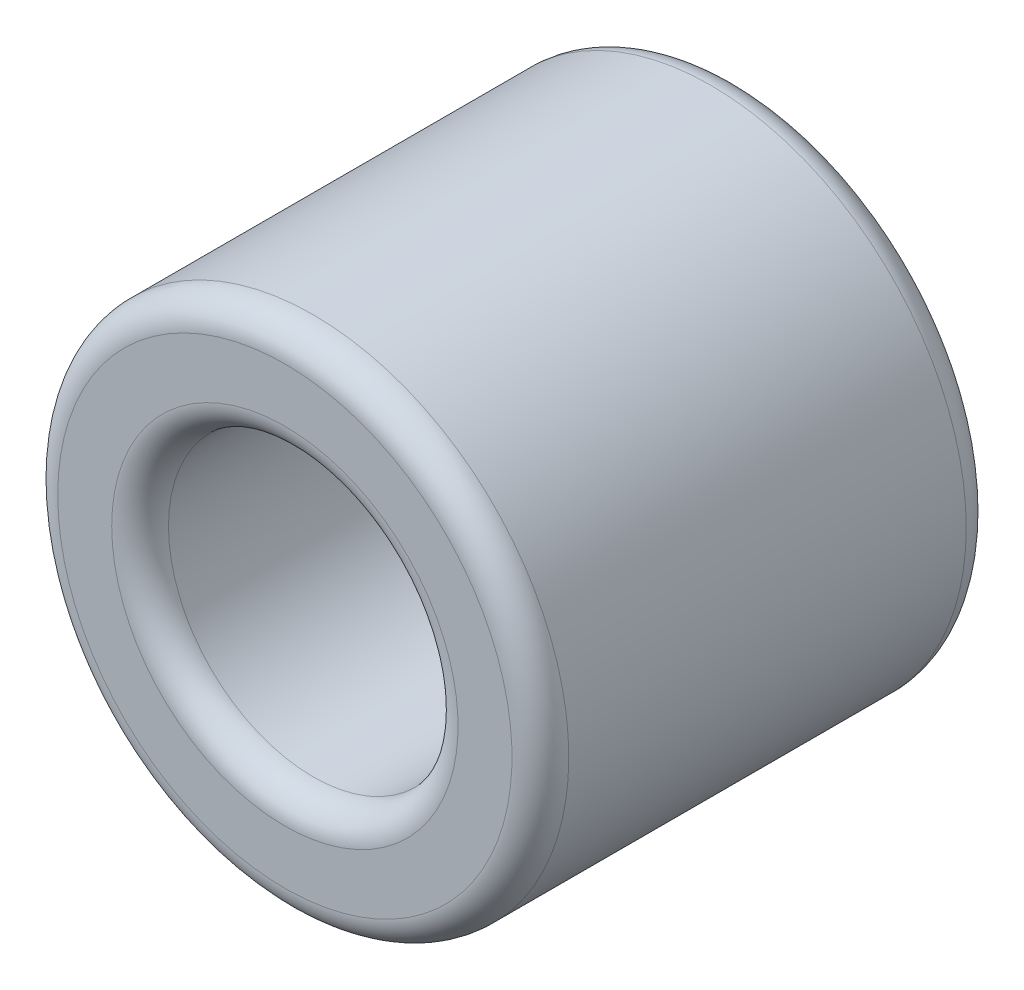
from build123d import *

# Parameters (mm, degrees)
SKETCH_1_W = 8
SKETCH_1_H = 1.95
FILLET_1_R = 0.5


with BuildPart() as part:
    # Sketch 1 → Revolve 1 (revolve)
    with BuildSketch(Plane(origin=(0, 0, 0), x_dir=(0, 0, -1), z_dir=(1, 0, 0)), mode=Mode.PRIVATE) as revolve_1_sk:
        with Locations((0, 3.525)):
            Rectangle(SKETCH_1_W, SKETCH_1_H)
    revolve(revolve_1_sk.sketch.rotate(Axis((0, 0, 4), (0, 0, -1)), 90), axis=Axis((0, 0, 4), (0, 0, -1)))

    # Fillet 1
    fillet_1_edges = [part.edges().sort_by_distance(p)[0] for p in [
        (-4.5, 0, 4),
        (-4.5, 0, -4),
        (-2.55, 0, -4),
        (-2.55, 0, 4),
    ]]
    fillet(fillet_1_edges, radius=FILLET_1_R)


solid = part.part
